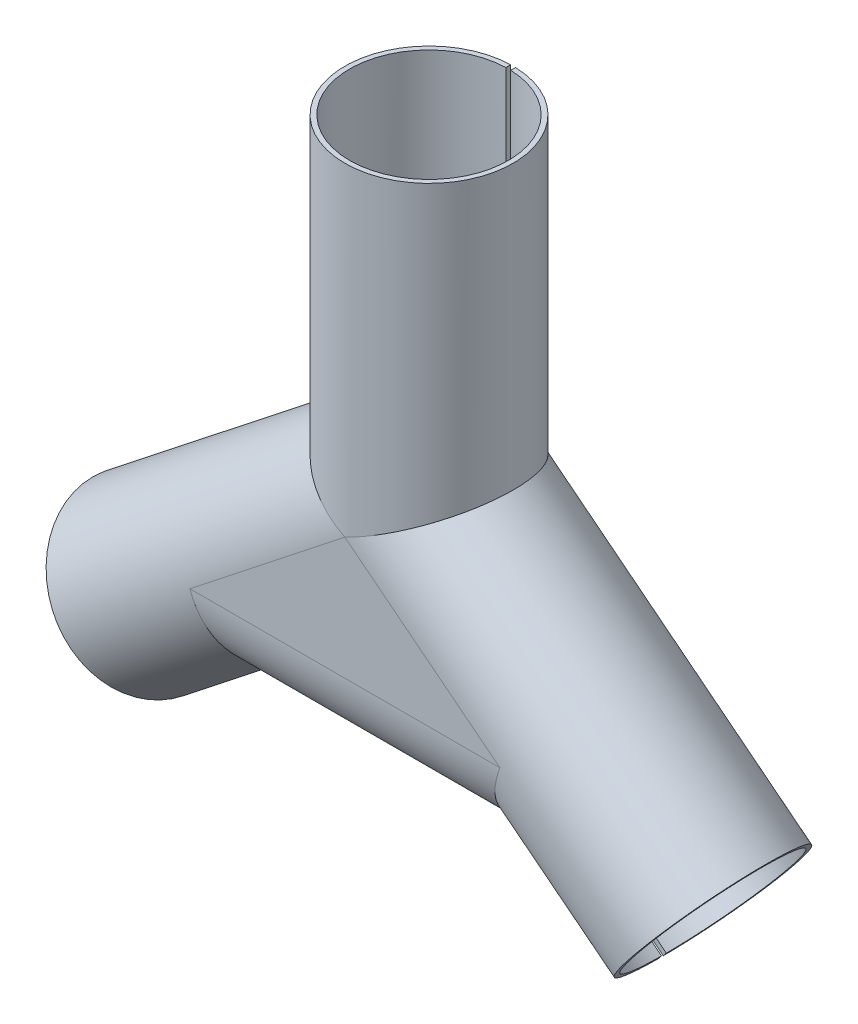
from build123d import *

# Parameters (mm, degrees)
SKETCH_2_R               = 17.484456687
SKETCH_2_R_2             = 16.484456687
EXTRUDE_1_DEPTH          = 67.288667
SKETCH_3_R               = 17.484456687
SKETCH_3_R_2             = 16.484456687
EXTRUDE_2_DEPTH          = 75.126203
EXTRUDE_3_DEPTH          = 6.062232
EXTRUDE_3_DEPTH_BACK     = 58.338161
SKETCH_4_R               = 17.484456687
SKETCH_4_R_2             = 16.484456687
CUT_EXTRUDE_1_DEPTH      = 99.534438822
CUT_EXTRUDE_1_DEPTH_BACK = 99.534438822
SKETCH_6_OUTSIDE_W       = 137.429
SKETCH_6_OUTSIDE_H       = 162.93
CUT_EXTRUDE_2_DEPTH      = 99.534438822
CUT_EXTRUDE_2_DEPTH_BACK = 99.534438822
SKETCH_7_OUTSIDE_W       = 137.429
SKETCH_7_OUTSIDE_H       = 162.93
CUT_EXTRUDE_3_DEPTH      = 99.534438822
CUT_EXTRUDE_3_DEPTH_BACK = 99.534438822
SKETCH_8_OUTSIDE_W       = 137.429
SKETCH_8_OUTSIDE_H       = 162.93
EXTRUDE_1_2_DEPTH        = 1
SKETCH_9_W               = 1
SKETCH_9_H               = 17.484456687
CUT_EXTRUDE_1_2_DEPTH    = 147.875945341
SKETCH_1_W               = 1
SKETCH_1_H               = 67.288666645
CUT_EXTRUDE_2_2_DEPTH    = 99.534438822


with BuildPart() as part:
    # Sketch 2 → Extrude 1 (new body)
    with BuildSketch(Plane(origin=(0, 0, 0), x_dir=(1, 0, 0), z_dir=(0, 1, 0))):
        Circle(SKETCH_2_R)
        Circle(SKETCH_2_R_2, mode=Mode.SUBTRACT)
    extrude(amount=EXTRUDE_1_DEPTH)

    # Sketch 6 outside → Cut-Extrude 1 (cut, two sides: drawn at the far end of the back side and taken through both)
    with BuildSketch(Plane.XY.offset(-CUT_EXTRUDE_1_DEPTH_BACK)):
        with Locations((18.8125, 3.526)):
            Rectangle(SKETCH_6_OUTSIDE_W, SKETCH_6_OUTSIDE_H)
        Polygon((0, 0), (17.484456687, 8.481507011), (17.484456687, 67.288666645), (-17.484456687, 67.288666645), (-17.484456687, 8.481507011), align=None, mode=Mode.SUBTRACT)
    extrude(amount=CUT_EXTRUDE_1_DEPTH + CUT_EXTRUDE_1_DEPTH_BACK, mode=Mode.SUBTRACT)

    # Sketch 1 → Cut-Extrude 2 2 (cut, through all)
    with BuildSketch(Plane.XY):
        with Locations((0, 33.644333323)):
            Rectangle(SKETCH_1_W, SKETCH_1_H)
    extrude(amount=-CUT_EXTRUDE_2_2_DEPTH, mode=Mode.SUBTRACT)


with BuildPart() as body_2:
    # Sketch 3 → Extrude 2 (new body)
    with BuildSketch(Plane(origin=(59.001913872, -46.505059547, 0), x_dir=(0, 0, -1), z_dir=(0.7853706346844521, -0.6190258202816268, 0))):
        Circle(SKETCH_3_R)
        Circle(SKETCH_3_R_2, mode=Mode.SUBTRACT)
    extrude(amount=-EXTRUDE_2_DEPTH)

    # Sketch 7 outside → Cut-Extrude 2 (cut, two sides: drawn at the far end of the back side and taken through both)
    with BuildSketch(Plane.XY.offset(-CUT_EXTRUDE_2_DEPTH_BACK)):
        with Locations((18.8125, 3.526)):
            Rectangle(SKETCH_7_OUTSIDE_W, SKETCH_7_OUTSIDE_H)
        Polygon((0, 0), (17.484456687, 8.481507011), (69.825244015, -32.773280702), (48.178583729, -60.236838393), (26.137964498, -42.864515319), (32.200196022, -25.380058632), align=None, mode=Mode.SUBTRACT)
    extrude(amount=CUT_EXTRUDE_2_DEPTH + CUT_EXTRUDE_2_DEPTH_BACK, mode=Mode.SUBTRACT)

    # Sketch 9 → Cut-Extrude 1 2 (cut, through all)
    with BuildSketch(Plane(origin=(59.001913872, -46.505059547, 0), x_dir=(0, 0, -1), z_dir=(0.7853706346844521, -0.6190258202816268, 0))):
        with Locations((0, -8.742228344)):
            Rectangle(SKETCH_9_W, SKETCH_9_H)
    extrude(amount=-CUT_EXTRUDE_1_2_DEPTH, mode=Mode.SUBTRACT)


with BuildPart() as body_3:
    # Sketch 4 → Extrude 3 (new, two sides: drawn at the far end of the back side and taken through both)
    with BuildSketch(Plane(origin=(26.137964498, -25.380058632, 0), x_dir=(0, 0, -1), z_dir=(1, 0, 0)).offset(-EXTRUDE_3_DEPTH_BACK)):
        Circle(SKETCH_4_R)
        Circle(SKETCH_4_R_2, mode=Mode.SUBTRACT)
    extrude(amount=EXTRUDE_3_DEPTH + EXTRUDE_3_DEPTH_BACK)

    # Sketch 8 outside → Cut-Extrude 3 (cut, two sides: drawn at the far end of the back side and taken through both)
    with BuildSketch(Plane.XY.offset(-CUT_EXTRUDE_3_DEPTH_BACK)):
        with Locations((18.8125, 3.526)):
            Rectangle(SKETCH_8_OUTSIDE_W, SKETCH_8_OUTSIDE_H)
        Polygon((26.137964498, -42.864515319), (32.200196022, -25.380058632), (-32.200196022, -25.380058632), (-26.137964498, -42.864515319), align=None, mode=Mode.SUBTRACT)
    extrude(amount=CUT_EXTRUDE_3_DEPTH + CUT_EXTRUDE_3_DEPTH_BACK, mode=Mode.SUBTRACT)

    # Sketch 5 → Extrude 1 2 (add)
    with BuildSketch(Plane.XY.offset(17.484456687)):
        Polygon((0, 0), (-32.200196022, -25.380058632), (32.200196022, -25.380058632), align=None)
    extrude_1_2 = extrude(amount=-EXTRUDE_1_2_DEPTH)

    # Mirror 1: Extrude 1 2 across plane
    add(extrude_1_2.mirror(Plane.XY))


with BuildPart() as body_4:
    # Mirror 2: mirrored copy
    add(body_2.part.mirror(Plane(origin=(0, 0, 0), x_dir=(0, 0, 1), z_dir=(1, 0, 0))))


solid = Compound([part.part, body_2.part, body_3.part, body_4.part])
